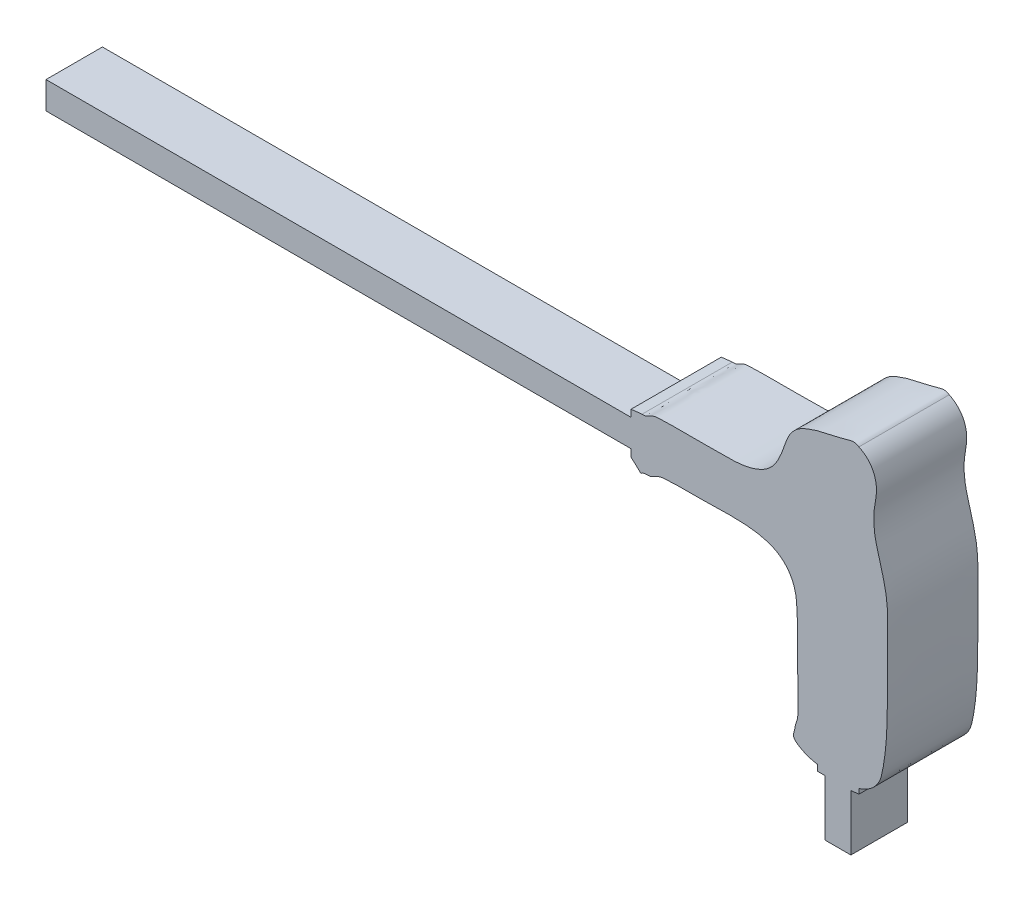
ISO-10303-21;
HEADER;
FILE_DESCRIPTION(('STEP AP214'),'2;1');
FILE_NAME('part.step','',(''),(''),'','','');
FILE_SCHEMA(('AUTOMOTIVE_DESIGN { 1 0 10303 214 1 1 1 1 }'));
ENDSEC;
DATA;
#1=APPLICATION_CONTEXT('core data for automotive mechanical design processes');
#2=APPLICATION_PROTOCOL_DEFINITION('international standard','automotive_design',2000,#1);
#3=PRODUCT_CONTEXT('',#1,'mechanical');
#4=PRODUCT('Part','Part','',(#3));
#5=PRODUCT_RELATED_PRODUCT_CATEGORY('part','',(#4));
#6=PRODUCT_DEFINITION_FORMATION('','',#4);
#7=PRODUCT_DEFINITION_CONTEXT('part definition',#1,'design');
#8=PRODUCT_DEFINITION('design','',#6,#7);
#9=PRODUCT_DEFINITION_SHAPE('','',#8);
#10=(LENGTH_UNIT() NAMED_UNIT(*) SI_UNIT(.MILLI.,.METRE.));
#11=(NAMED_UNIT(*) PLANE_ANGLE_UNIT() SI_UNIT($,.RADIAN.));
#12=(NAMED_UNIT(*) SI_UNIT($,.STERADIAN.) SOLID_ANGLE_UNIT());
#13=UNCERTAINTY_MEASURE_WITH_UNIT(LENGTH_MEASURE(1.E-05),#10,'distance_accuracy_value','');
#14=(GEOMETRIC_REPRESENTATION_CONTEXT(3) GLOBAL_UNCERTAINTY_ASSIGNED_CONTEXT((#13)) GLOBAL_UNIT_ASSIGNED_CONTEXT((#10,
#11,#12)) REPRESENTATION_CONTEXT('',''));
#15=CARTESIAN_POINT('',(0.,0.,0.));
#16=DIRECTION('',(0.,0.,1.));
#17=DIRECTION('',(1.,0.,0.));
#18=AXIS2_PLACEMENT_3D('',#15,#16,#17);
#19=CARTESIAN_POINT('',(244.200239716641,76.7357312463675,-10.));
#20=DIRECTION('',(1.,0.,0.));
#21=DIRECTION('',(0.,0.,-1.));
#22=AXIS2_PLACEMENT_3D('',#19,#20,#21);
#23=PLANE('',#22);
#24=DIRECTION('',(0.,0.,1.));
#25=VECTOR('',#24,1.);
#26=CARTESIAN_POINT('',(244.200239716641,64.3599855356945,-10.));
#27=LINE('',#26,#25);
#28=CARTESIAN_POINT('',(244.200239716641,64.3599855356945,-2.5));
#29=VERTEX_POINT('',#28);
#30=CARTESIAN_POINT('',(244.200239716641,64.3599855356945,10.));
#31=VERTEX_POINT('',#30);
#32=EDGE_CURVE('E195',#29,#31,#27,.T.);
#33=ORIENTED_EDGE('',*,*,#32,.F.);
#34=DIRECTION('',(0.,-1.,0.));
#35=VECTOR('',#34,1.);
#36=CARTESIAN_POINT('',(244.200239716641,64.3599855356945,-2.5));
#37=LINE('',#36,#35);
#38=CARTESIAN_POINT('',(244.200239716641,76.7357312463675,-2.5));
#39=VERTEX_POINT('',#38);
#40=EDGE_CURVE('E173',#39,#29,#37,.T.);
#41=ORIENTED_EDGE('',*,*,#40,.F.);
#42=DIRECTION('',(0.,0.,1.));
#43=VECTOR('',#42,1.);
#44=CARTESIAN_POINT('',(244.200239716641,76.7357312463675,-10.));
#45=LINE('',#44,#43);
#46=CARTESIAN_POINT('',(244.200239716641,76.7357312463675,10.));
#47=VERTEX_POINT('',#46);
#48=EDGE_CURVE('E248',#39,#47,#45,.T.);
#49=ORIENTED_EDGE('',*,*,#48,.T.);
#50=DIRECTION('',(0.,1.,0.));
#51=VECTOR('',#50,1.);
#52=CARTESIAN_POINT('',(244.200239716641,76.7357312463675,10.));
#53=LINE('',#52,#51);
#54=EDGE_CURVE('E259',#31,#47,#53,.T.);
#55=ORIENTED_EDGE('',*,*,#54,.F.);
#56=EDGE_LOOP('',(#33,#41,#49,#55));
#57=FACE_BOUND('',#56,.T.);
#58=ADVANCED_FACE('F39',(#57),#23,.T.);
#59=CARTESIAN_POINT('',(244.200239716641,64.3599855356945,-10.));
#60=DIRECTION('',(0.,-1.,0.));
#61=DIRECTION('',(0.,0.,-1.));
#62=AXIS2_PLACEMENT_3D('',#59,#60,#61);
#63=PLANE('',#62);
#64=DIRECTION('',(0.,0.,1.));
#65=VECTOR('',#64,1.);
#66=CARTESIAN_POINT('',(238.4335121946,64.3599855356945,-10.));
#67=LINE('',#66,#65);
#68=CARTESIAN_POINT('',(238.4335121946,64.3599855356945,-2.5));
#69=VERTEX_POINT('',#68);
#70=CARTESIAN_POINT('',(238.4335121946,64.3599855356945,10.));
#71=VERTEX_POINT('',#70);
#72=EDGE_CURVE('E190',#69,#71,#67,.T.);
#73=ORIENTED_EDGE('',*,*,#72,.F.);
#74=DIRECTION('',(-1.,0.,0.));
#75=VECTOR('',#74,1.);
#76=CARTESIAN_POINT('',(238.4335121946,64.3599855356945,-2.5));
#77=LINE('',#76,#75);
#78=EDGE_CURVE('E179',#29,#69,#77,.T.);
#79=ORIENTED_EDGE('',*,*,#78,.F.);
#80=ORIENTED_EDGE('',*,*,#32,.T.);
#81=DIRECTION('',(1.,0.,0.));
#82=VECTOR('',#81,1.);
#83=CARTESIAN_POINT('',(244.200239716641,64.3599855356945,10.));
#84=LINE('',#83,#82);
#85=EDGE_CURVE('E269',#71,#31,#84,.T.);
#86=ORIENTED_EDGE('',*,*,#85,.F.);
#87=EDGE_LOOP('',(#73,#79,#80,#86));
#88=FACE_BOUND('',#87,.T.);
#89=ADVANCED_FACE('F349',(#88),#63,.T.);
#90=CARTESIAN_POINT('',(238.4335121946,64.3599855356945,-10.));
#91=DIRECTION('',(-1.,0.,0.));
#92=DIRECTION('',(0.,0.,1.));
#93=AXIS2_PLACEMENT_3D('',#90,#91,#92);
#94=PLANE('',#93);
#95=DIRECTION('',(0.,0.,1.));
#96=VECTOR('',#95,1.);
#97=CARTESIAN_POINT('',(238.4335121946,76.7357312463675,-10.));
#98=LINE('',#97,#96);
#99=CARTESIAN_POINT('',(238.4335121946,76.7357312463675,-2.5));
#100=VERTEX_POINT('',#99);
#101=CARTESIAN_POINT('',(238.4335121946,76.7357312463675,10.));
#102=VERTEX_POINT('',#101);
#103=EDGE_CURVE('E166',#100,#102,#98,.T.);
#104=ORIENTED_EDGE('',*,*,#103,.F.);
#105=DIRECTION('',(0.,1.,0.));
#106=VECTOR('',#105,1.);
#107=CARTESIAN_POINT('',(238.4335121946,64.3599855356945,-2.5));
#108=LINE('',#107,#106);
#109=EDGE_CURVE('E174',#69,#100,#108,.T.);
#110=ORIENTED_EDGE('',*,*,#109,.F.);
#111=ORIENTED_EDGE('',*,*,#72,.T.);
#112=DIRECTION('',(0.,-1.,0.));
#113=VECTOR('',#112,1.);
#114=CARTESIAN_POINT('',(238.4335121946,64.3599855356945,10.));
#115=LINE('',#114,#113);
#116=EDGE_CURVE('E188',#102,#71,#115,.T.);
#117=ORIENTED_EDGE('',*,*,#116,.F.);
#118=EDGE_LOOP('',(#104,#110,#111,#117));
#119=FACE_BOUND('',#118,.T.);
#120=ADVANCED_FACE('F186',(#119),#94,.T.);
#121=CARTESIAN_POINT('',(195.497714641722,125.540072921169,-10.));
#122=DIRECTION('',(-0.111022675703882,0.993817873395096,0.));
#123=DIRECTION('',(-0.993817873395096,-0.111022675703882,0.));
#124=AXIS2_PLACEMENT_3D('',#121,#122,#123);
#125=PLANE('',#124);
#126=DIRECTION('',(0.,0.,1.));
#127=VECTOR('',#126,1.);
#128=CARTESIAN_POINT('',(195.497714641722,125.540072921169,-10.));
#129=LINE('',#128,#127);
#130=CARTESIAN_POINT('',(195.497714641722,125.540072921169,-10.));
#131=VERTEX_POINT('',#130);
#132=CARTESIAN_POINT('',(195.497714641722,125.540072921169,10.));
#133=VERTEX_POINT('',#132);
#134=EDGE_CURVE('E11',#131,#133,#129,.T.);
#135=ORIENTED_EDGE('',*,*,#134,.T.);
#136=DIRECTION('',(-0.993817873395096,-0.111022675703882,0.));
#137=VECTOR('',#136,1.);
#138=CARTESIAN_POINT('',(195.497714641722,125.540072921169,10.));
#139=LINE('',#138,#137);
#140=CARTESIAN_POINT('',(197.943057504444,125.813250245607,10.));
#141=VERTEX_POINT('',#140);
#142=EDGE_CURVE('E296',#141,#133,#139,.T.);
#143=ORIENTED_EDGE('',*,*,#142,.F.);
#144=DIRECTION('',(0.,0.,1.));
#145=VECTOR('',#144,1.);
#146=CARTESIAN_POINT('',(197.943057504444,125.813250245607,-10.));
#147=LINE('',#146,#145);
#148=CARTESIAN_POINT('',(197.943057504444,125.813250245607,-10.));
#149=VERTEX_POINT('',#148);
#150=EDGE_CURVE('E49',#149,#141,#147,.T.);
#151=ORIENTED_EDGE('',*,*,#150,.F.);
#152=DIRECTION('',(-0.993817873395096,-0.111022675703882,0.));
#153=VECTOR('',#152,1.);
#154=CARTESIAN_POINT('',(195.497714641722,125.540072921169,-10.));
#155=LINE('',#154,#153);
#156=EDGE_CURVE('E222',#149,#131,#155,.T.);
#157=ORIENTED_EDGE('',*,*,#156,.T.);
#158=EDGE_LOOP('',(#135,#143,#151,#157));
#159=FACE_BOUND('',#158,.T.);
#160=ADVANCED_FACE('F359',(#159),#125,.T.);
#161=CARTESIAN_POINT('',(245.99184260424,143.557265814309,-10.));
#162=CARTESIAN_POINT('',(245.078392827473,144.226488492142,-10.));
#163=CARTESIAN_POINT('',(242.148541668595,143.16497191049,-10.));
#164=CARTESIAN_POINT('',(238.253004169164,142.539143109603,-10.));
#165=CARTESIAN_POINT('',(234.684818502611,141.446956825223,-10.));
#166=CARTESIAN_POINT('',(232.208881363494,140.197703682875,-10.));
#167=CARTESIAN_POINT('',(230.148539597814,137.918538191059,-10.));
#168=CARTESIAN_POINT('',(229.092041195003,133.98962434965,-10.));
#169=CARTESIAN_POINT('',(226.975041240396,129.687062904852,-10.));
#170=CARTESIAN_POINT('',(222.661130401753,127.486615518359,-10.));
#171=CARTESIAN_POINT('',(218.627037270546,126.936784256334,-10.));
#172=CARTESIAN_POINT('',(214.848083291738,127.007534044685,-10.));
#173=CARTESIAN_POINT('',(211.54134581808,126.935471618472,-10.));
#174=CARTESIAN_POINT('',(208.474048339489,126.954576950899,-10.));
#175=CARTESIAN_POINT('',(205.558901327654,126.94550967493,-10.));
#176=CARTESIAN_POINT('',(203.289474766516,126.962166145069,-10.));
#177=CARTESIAN_POINT('',(201.643976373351,126.851415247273,-10.));
#178=CARTESIAN_POINT('',(199.959921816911,126.762022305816,-10.));
#179=CARTESIAN_POINT('',(198.992423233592,125.653607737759,-10.));
#180=CARTESIAN_POINT('',(197.943057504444,125.813250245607,-10.));
#181=B_SPLINE_CURVE_WITH_KNOTS('',3,(#161,#162,#163,#164,#165,#166,#167,#168,#169,#170,#171,
#172,#173,#174,#175,#176,#177,#178,#179,#180),.UNSPECIFIED.,.F.,.F.,(4,1,1,1,1,1,1,1,1,1,1,1,1,
1,1,1,1,4),(0.,0.0567406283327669,0.152495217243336,0.220657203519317,0.25588331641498,
0.301296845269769,0.381016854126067,0.474190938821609,0.548887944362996,0.631271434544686,
0.692674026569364,0.752836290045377,0.809894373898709,0.858269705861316,0.910369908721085,
0.932112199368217,0.947728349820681,1.),.UNSPECIFIED.);
#182=DIRECTION('',(0.,0.,1.));
#183=VECTOR('',#182,1.);
#184=SURFACE_OF_LINEAR_EXTRUSION('',#181,#183);
#185=ORIENTED_EDGE('',*,*,#150,.T.);
#186=CARTESIAN_POINT('',(245.99184260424,143.557265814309,10.));
#187=CARTESIAN_POINT('',(245.078392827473,144.226488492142,10.));
#188=CARTESIAN_POINT('',(242.148541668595,143.16497191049,10.));
#189=CARTESIAN_POINT('',(238.253004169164,142.539143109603,10.));
#190=CARTESIAN_POINT('',(234.684818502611,141.446956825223,10.));
#191=CARTESIAN_POINT('',(232.208881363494,140.197703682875,10.));
#192=CARTESIAN_POINT('',(230.148539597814,137.918538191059,10.));
#193=CARTESIAN_POINT('',(229.092041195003,133.98962434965,10.));
#194=CARTESIAN_POINT('',(226.975041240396,129.687062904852,10.));
#195=CARTESIAN_POINT('',(222.661130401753,127.486615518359,10.));
#196=CARTESIAN_POINT('',(218.627037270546,126.936784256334,10.));
#197=CARTESIAN_POINT('',(214.848083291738,127.007534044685,10.));
#198=CARTESIAN_POINT('',(211.54134581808,126.935471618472,10.));
#199=CARTESIAN_POINT('',(208.474048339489,126.954576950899,10.));
#200=CARTESIAN_POINT('',(205.558901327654,126.94550967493,10.));
#201=CARTESIAN_POINT('',(203.289474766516,126.962166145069,10.));
#202=CARTESIAN_POINT('',(201.643976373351,126.851415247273,10.));
#203=CARTESIAN_POINT('',(199.959921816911,126.762022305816,10.));
#204=CARTESIAN_POINT('',(198.992423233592,125.653607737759,10.));
#205=CARTESIAN_POINT('',(197.943057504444,125.813250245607,10.));
#206=B_SPLINE_CURVE_WITH_KNOTS('',3,(#186,#187,#188,#189,#190,#191,#192,#193,#194,#195,#196,
#197,#198,#199,#200,#201,#202,#203,#204,#205),.UNSPECIFIED.,.F.,.F.,(4,1,1,1,1,1,1,1,1,1,1,1,1,
1,1,1,1,4),(0.,0.0567406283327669,0.152495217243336,0.220657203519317,0.25588331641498,
0.301296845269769,0.381016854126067,0.474190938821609,0.548887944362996,0.631271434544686,
0.692674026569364,0.752836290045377,0.809894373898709,0.858269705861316,0.910369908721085,
0.932112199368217,0.947728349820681,1.),.UNSPECIFIED.);
#207=CARTESIAN_POINT('',(245.99184260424,143.557265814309,10.));
#208=VERTEX_POINT('',#207);
#209=EDGE_CURVE('E287',#208,#141,#206,.T.);
#210=ORIENTED_EDGE('',*,*,#209,.F.);
#211=DIRECTION('',(0.,0.,1.));
#212=VECTOR('',#211,1.);
#213=CARTESIAN_POINT('',(245.99184260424,143.557265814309,-10.));
#214=LINE('',#213,#212);
#215=CARTESIAN_POINT('',(245.99184260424,143.557265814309,-10.));
#216=VERTEX_POINT('',#215);
#217=EDGE_CURVE('E238',#216,#208,#214,.T.);
#218=ORIENTED_EDGE('',*,*,#217,.F.);
#219=EDGE_CURVE('E225',#216,#149,#181,.T.);
#220=ORIENTED_EDGE('',*,*,#219,.T.);
#221=EDGE_LOOP('',(#185,#210,#218,#220));
#222=FACE_BOUND('',#221,.T.);
#223=ADVANCED_FACE('F375',(#222),#184,.T.);
#224=CARTESIAN_POINT('',(245.99184260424,78.0425217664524,-10.));
#225=CARTESIAN_POINT('',(247.801295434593,78.5203071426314,-10.));
#226=CARTESIAN_POINT('',(250.49725531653,80.4975512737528,-10.));
#227=CARTESIAN_POINT('',(251.418067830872,84.8854401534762,-10.));
#228=CARTESIAN_POINT('',(252.06566440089,89.5057606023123,-10.));
#229=CARTESIAN_POINT('',(252.288645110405,95.240217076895,-10.));
#230=CARTESIAN_POINT('',(252.379557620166,101.542835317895,-10.));
#231=CARTESIAN_POINT('',(252.358522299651,107.105758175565,-10.));
#232=CARTESIAN_POINT('',(252.35982701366,112.122415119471,-10.));
#233=CARTESIAN_POINT('',(252.36935219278,116.605449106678,-10.));
#234=CARTESIAN_POINT('',(251.42488519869,121.264419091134,-10.));
#235=CARTESIAN_POINT('',(250.23433298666,125.223812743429,-10.));
#236=CARTESIAN_POINT('',(249.354587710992,128.763510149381,-10.));
#237=CARTESIAN_POINT('',(249.268414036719,131.222384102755,-10.));
#238=CARTESIAN_POINT('',(249.319190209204,133.663097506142,-10.));
#239=CARTESIAN_POINT('',(249.870199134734,135.851869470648,-10.));
#240=CARTESIAN_POINT('',(249.913740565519,138.419589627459,-10.));
#241=CARTESIAN_POINT('',(248.993977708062,141.361715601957,-10.));
#242=CARTESIAN_POINT('',(247.266442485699,142.968169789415,-10.));
#243=CARTESIAN_POINT('',(245.99184260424,143.557265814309,-10.));
#244=B_SPLINE_CURVE_WITH_KNOTS('',3,(#224,#225,#226,#227,#228,#229,#230,#231,#232,#233,#234,
#235,#236,#237,#238,#239,#240,#241,#242,#243),.UNSPECIFIED.,.F.,.F.,(4,1,1,1,1,1,1,1,1,1,1,1,1,
1,1,1,1,4),(0.,0.0819029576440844,0.126703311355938,0.188499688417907,0.283419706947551,
0.372425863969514,0.459545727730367,0.522309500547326,0.588149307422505,0.65153729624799,
0.725488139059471,0.766125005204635,0.807622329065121,0.830764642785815,0.870758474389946,
0.903996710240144,0.939948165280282,1.),.UNSPECIFIED.);
#245=DIRECTION('',(0.,0.,1.));
#246=VECTOR('',#245,1.);
#247=SURFACE_OF_LINEAR_EXTRUSION('',#244,#246);
#248=ORIENTED_EDGE('',*,*,#217,.T.);
#249=CARTESIAN_POINT('',(245.99184260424,78.0425217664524,10.));
#250=CARTESIAN_POINT('',(247.801295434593,78.5203071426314,10.));
#251=CARTESIAN_POINT('',(250.49725531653,80.4975512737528,10.));
#252=CARTESIAN_POINT('',(251.418067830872,84.8854401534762,10.));
#253=CARTESIAN_POINT('',(252.06566440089,89.5057606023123,10.));
#254=CARTESIAN_POINT('',(252.288645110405,95.240217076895,10.));
#255=CARTESIAN_POINT('',(252.379557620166,101.542835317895,10.));
#256=CARTESIAN_POINT('',(252.358522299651,107.105758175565,10.));
#257=CARTESIAN_POINT('',(252.35982701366,112.122415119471,10.));
#258=CARTESIAN_POINT('',(252.36935219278,116.605449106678,10.));
#259=CARTESIAN_POINT('',(251.42488519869,121.264419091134,10.));
#260=CARTESIAN_POINT('',(250.23433298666,125.223812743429,10.));
#261=CARTESIAN_POINT('',(249.354587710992,128.763510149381,10.));
#262=CARTESIAN_POINT('',(249.268414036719,131.222384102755,10.));
#263=CARTESIAN_POINT('',(249.319190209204,133.663097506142,10.));
#264=CARTESIAN_POINT('',(249.870199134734,135.851869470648,10.));
#265=CARTESIAN_POINT('',(249.913740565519,138.419589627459,10.));
#266=CARTESIAN_POINT('',(248.993977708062,141.361715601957,10.));
#267=CARTESIAN_POINT('',(247.266442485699,142.968169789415,10.));
#268=CARTESIAN_POINT('',(245.99184260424,143.557265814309,10.));
#269=B_SPLINE_CURVE_WITH_KNOTS('',3,(#249,#250,#251,#252,#253,#254,#255,#256,#257,#258,#259,
#260,#261,#262,#263,#264,#265,#266,#267,#268),.UNSPECIFIED.,.F.,.F.,(4,1,1,1,1,1,1,1,1,1,1,1,1,
1,1,1,1,4),(0.,0.0819029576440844,0.126703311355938,0.188499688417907,0.283419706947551,
0.372425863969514,0.459545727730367,0.522309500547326,0.588149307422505,0.65153729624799,
0.725488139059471,0.766125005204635,0.807622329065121,0.830764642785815,0.870758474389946,
0.903996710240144,0.939948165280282,1.),.UNSPECIFIED.);
#270=CARTESIAN_POINT('',(245.99184260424,78.0425217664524,10.));
#271=VERTEX_POINT('',#270);
#272=EDGE_CURVE('E278',#271,#208,#269,.T.);
#273=ORIENTED_EDGE('',*,*,#272,.F.);
#274=DIRECTION('',(0.,0.,1.));
#275=VECTOR('',#274,1.);
#276=CARTESIAN_POINT('',(245.99184260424,78.0425217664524,-10.));
#277=LINE('',#276,#275);
#278=CARTESIAN_POINT('',(245.99184260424,78.0425217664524,-10.));
#279=VERTEX_POINT('',#278);
#280=EDGE_CURVE('E241',#279,#271,#277,.T.);
#281=ORIENTED_EDGE('',*,*,#280,.F.);
#282=EDGE_CURVE('E229',#279,#216,#244,.T.);
#283=ORIENTED_EDGE('',*,*,#282,.T.);
#284=EDGE_LOOP('',(#248,#273,#281,#283));
#285=FACE_BOUND('',#284,.T.);
#286=ADVANCED_FACE('F370',(#285),#247,.T.);
#287=CARTESIAN_POINT('',(245.99184260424,78.0425217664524,-10.));
#288=DIRECTION('',(1.,0.,0.));
#289=DIRECTION('',(0.,0.,-1.));
#290=AXIS2_PLACEMENT_3D('',#287,#288,#289);
#291=PLANE('',#290);
#292=ORIENTED_EDGE('',*,*,#280,.T.);
#293=DIRECTION('',(0.,1.,0.));
#294=VECTOR('',#293,1.);
#295=CARTESIAN_POINT('',(245.99184260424,78.0425217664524,10.));
#296=LINE('',#295,#294);
#297=CARTESIAN_POINT('',(245.99184260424,76.935877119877,10.));
#298=VERTEX_POINT('',#297);
#299=EDGE_CURVE('E275',#298,#271,#296,.T.);
#300=ORIENTED_EDGE('',*,*,#299,.F.);
#301=DIRECTION('',(0.,0.,1.));
#302=VECTOR('',#301,1.);
#303=CARTESIAN_POINT('',(245.99184260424,76.935877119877,-10.));
#304=LINE('',#303,#302);
#305=CARTESIAN_POINT('',(245.99184260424,76.935877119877,-10.));
#306=VERTEX_POINT('',#305);
#307=EDGE_CURVE('E244',#306,#298,#304,.T.);
#308=ORIENTED_EDGE('',*,*,#307,.F.);
#309=DIRECTION('',(0.,1.,0.));
#310=VECTOR('',#309,1.);
#311=CARTESIAN_POINT('',(245.99184260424,78.0425217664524,-10.));
#312=LINE('',#311,#310);
#313=EDGE_CURVE('E386',#306,#279,#312,.T.);
#314=ORIENTED_EDGE('',*,*,#313,.T.);
#315=EDGE_LOOP('',(#292,#300,#308,#314));
#316=FACE_BOUND('',#315,.T.);
#317=ADVANCED_FACE('F366',(#316),#291,.T.);
#318=CARTESIAN_POINT('',(245.99184260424,76.935877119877,-10.));
#319=DIRECTION('',(0.111022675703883,-0.993817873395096,0.));
#320=DIRECTION('',(0.993817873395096,0.111022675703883,0.));
#321=AXIS2_PLACEMENT_3D('',#318,#319,#320);
#322=PLANE('',#321);
#323=ORIENTED_EDGE('',*,*,#307,.T.);
#324=DIRECTION('',(0.993817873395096,0.111022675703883,0.));
#325=VECTOR('',#324,1.);
#326=CARTESIAN_POINT('',(245.99184260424,76.935877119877,10.));
#327=LINE('',#326,#325);
#328=EDGE_CURVE('E267',#47,#298,#327,.T.);
#329=ORIENTED_EDGE('',*,*,#328,.F.);
#330=ORIENTED_EDGE('',*,*,#48,.F.);
#331=CARTESIAN_POINT('',(244.200239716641,76.7357312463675,-10.));
#332=VERTEX_POINT('',#331);
#333=EDGE_CURVE('E169',#332,#39,#45,.T.);
#334=ORIENTED_EDGE('',*,*,#333,.F.);
#335=DIRECTION('',(0.993817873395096,0.111022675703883,0.));
#336=VECTOR('',#335,1.);
#337=CARTESIAN_POINT('',(245.99184260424,76.935877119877,-10.));
#338=LINE('',#337,#336);
#339=EDGE_CURVE('E393',#332,#306,#338,.T.);
#340=ORIENTED_EDGE('',*,*,#339,.T.);
#341=EDGE_LOOP('',(#323,#329,#330,#334,#340));
#342=FACE_BOUND('',#341,.T.);
#343=ADVANCED_FACE('F272',(#342),#322,.T.);
#344=CARTESIAN_POINT('',(238.4335121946,76.7357312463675,-10.));
#345=DIRECTION('',(0.,-1.,0.));
#346=DIRECTION('',(0.,0.,-1.));
#347=AXIS2_PLACEMENT_3D('',#344,#345,#346);
#348=PLANE('',#347);
#349=DIRECTION('',(1.,0.,0.));
#350=VECTOR('',#349,1.);
#351=CARTESIAN_POINT('',(238.4335121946,76.7357312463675,-10.));
#352=LINE('',#351,#350);
#353=CARTESIAN_POINT('',(236.843581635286,76.7357312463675,-10.));
#354=VERTEX_POINT('',#353);
#355=EDGE_CURVE('E395',#354,#332,#352,.T.);
#356=ORIENTED_EDGE('',*,*,#355,.T.);
#357=ORIENTED_EDGE('',*,*,#333,.T.);
#358=DIRECTION('',(1.,0.,0.));
#359=VECTOR('',#358,1.);
#360=CARTESIAN_POINT('',(238.4335121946,76.7357312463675,-2.5));
#361=LINE('',#360,#359);
#362=EDGE_CURVE('E161',#100,#39,#361,.T.);
#363=ORIENTED_EDGE('',*,*,#362,.F.);
#364=ORIENTED_EDGE('',*,*,#103,.T.);
#365=DIRECTION('',(1.,0.,0.));
#366=VECTOR('',#365,1.);
#367=CARTESIAN_POINT('',(238.4335121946,76.7357312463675,10.));
#368=LINE('',#367,#366);
#369=CARTESIAN_POINT('',(236.843581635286,76.7357312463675,10.));
#370=VERTEX_POINT('',#369);
#371=EDGE_CURVE('E435',#370,#102,#368,.T.);
#372=ORIENTED_EDGE('',*,*,#371,.F.);
#373=DIRECTION('',(0.,0.,1.));
#374=VECTOR('',#373,1.);
#375=CARTESIAN_POINT('',(236.843581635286,76.7357312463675,-10.));
#376=LINE('',#375,#374);
#377=EDGE_CURVE('E191',#354,#370,#376,.T.);
#378=ORIENTED_EDGE('',*,*,#377,.F.);
#379=EDGE_LOOP('',(#356,#357,#363,#364,#372,#378));
#380=FACE_BOUND('',#379,.T.);
#381=ADVANCED_FACE('F163',(#380),#348,.T.);
#382=CARTESIAN_POINT('',(236.843581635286,76.7357312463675,-10.));
#383=DIRECTION('',(-1.,0.,0.));
#384=DIRECTION('',(0.,0.,1.));
#385=AXIS2_PLACEMENT_3D('',#382,#383,#384);
#386=PLANE('',#385);
#387=ORIENTED_EDGE('',*,*,#377,.T.);
#388=DIRECTION('',(0.,-1.,0.));
#389=VECTOR('',#388,1.);
#390=CARTESIAN_POINT('',(236.843581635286,76.7357312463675,10.));
#391=LINE('',#390,#389);
#392=CARTESIAN_POINT('',(236.843581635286,78.0425217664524,10.));
#393=VERTEX_POINT('',#392);
#394=EDGE_CURVE('E422',#393,#370,#391,.T.);
#395=ORIENTED_EDGE('',*,*,#394,.F.);
#396=DIRECTION('',(0.,0.,1.));
#397=VECTOR('',#396,1.);
#398=CARTESIAN_POINT('',(236.843581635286,78.0425217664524,-10.));
#399=LINE('',#398,#397);
#400=CARTESIAN_POINT('',(236.843581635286,78.0425217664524,-10.));
#401=VERTEX_POINT('',#400);
#402=EDGE_CURVE('E197',#401,#393,#399,.T.);
#403=ORIENTED_EDGE('',*,*,#402,.F.);
#404=DIRECTION('',(0.,-1.,0.));
#405=VECTOR('',#404,1.);
#406=CARTESIAN_POINT('',(236.843581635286,76.7357312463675,-10.));
#407=LINE('',#406,#405);
#408=EDGE_CURVE('E317',#401,#354,#407,.T.);
#409=ORIENTED_EDGE('',*,*,#408,.T.);
#410=EDGE_LOOP('',(#387,#395,#403,#409));
#411=FACE_BOUND('',#410,.T.);
#412=ADVANCED_FACE('F328',(#411),#386,.T.);
#413=CARTESIAN_POINT('',(197.705183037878,114.309075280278,-10.));
#414=CARTESIAN_POINT('',(198.232852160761,114.845899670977,-10.));
#415=CARTESIAN_POINT('',(199.876415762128,114.437945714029,-10.));
#416=CARTESIAN_POINT('',(201.411409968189,115.788128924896,-10.));
#417=CARTESIAN_POINT('',(205.015840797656,116.116279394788,-10.));
#418=CARTESIAN_POINT('',(210.27428122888,115.968831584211,-10.));
#419=CARTESIAN_POINT('',(217.495331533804,116.283400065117,-10.));
#420=CARTESIAN_POINT('',(223.748837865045,116.02177246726,-10.));
#421=CARTESIAN_POINT('',(228.28072075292,114.375318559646,-10.));
#422=CARTESIAN_POINT('',(230.552288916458,112.024802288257,-10.));
#423=CARTESIAN_POINT('',(231.902730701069,109.310050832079,-10.));
#424=CARTESIAN_POINT('',(232.375496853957,105.606473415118,-10.));
#425=CARTESIAN_POINT('',(232.295179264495,101.04459366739,-10.));
#426=CARTESIAN_POINT('',(232.47067030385,95.8930228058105,-10.));
#427=CARTESIAN_POINT('',(232.45446207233,91.5434529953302,-10.));
#428=CARTESIAN_POINT('',(232.398121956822,87.9551687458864,-10.));
#429=CARTESIAN_POINT('',(232.561197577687,85.7866572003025,-10.));
#430=CARTESIAN_POINT('',(232.290333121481,84.1822785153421,-10.));
#431=CARTESIAN_POINT('',(231.859692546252,83.1844647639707,-10.));
#432=CARTESIAN_POINT('',(231.780761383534,82.0532266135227,-10.));
#433=CARTESIAN_POINT('',(231.198458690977,80.6143984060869,-10.));
#434=CARTESIAN_POINT('',(233.521456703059,78.8446305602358,-10.));
#435=CARTESIAN_POINT('',(235.284562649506,78.3162999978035,-10.));
#436=CARTESIAN_POINT('',(236.843581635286,78.0425217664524,-10.));
#437=B_SPLINE_CURVE_WITH_KNOTS('',3,(#413,#414,#415,#416,#417,#418,#419,#420,#421,#422,#423,
#424,#425,#426,#427,#428,#429,#430,#431,#432,#433,#434,#435,#436),.UNSPECIFIED.,.F.,.F.,(4,1,1,
1,1,1,1,1,1,1,1,1,1,1,1,1,1,1,1,1,1,4),(0.,0.028350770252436,0.0618772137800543,
0.0777315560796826,0.177302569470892,0.282081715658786,0.378694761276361,0.436891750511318,
0.477373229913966,0.51173289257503,0.561611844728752,0.630861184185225,0.702248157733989,
0.776277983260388,0.812091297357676,0.85192640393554,0.866314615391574,0.879521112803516,
0.89653224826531,0.914436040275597,0.936716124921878,1.),.UNSPECIFIED.);
#438=DIRECTION('',(0.,0.,1.));
#439=VECTOR('',#438,1.);
#440=SURFACE_OF_LINEAR_EXTRUSION('',#437,#439);
#441=ORIENTED_EDGE('',*,*,#402,.T.);
#442=CARTESIAN_POINT('',(197.705183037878,114.309075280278,10.));
#443=CARTESIAN_POINT('',(198.232852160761,114.845899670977,10.));
#444=CARTESIAN_POINT('',(199.876415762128,114.437945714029,10.));
#445=CARTESIAN_POINT('',(201.411409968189,115.788128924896,10.));
#446=CARTESIAN_POINT('',(205.015840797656,116.116279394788,10.));
#447=CARTESIAN_POINT('',(210.27428122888,115.968831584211,10.));
#448=CARTESIAN_POINT('',(217.495331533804,116.283400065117,10.));
#449=CARTESIAN_POINT('',(223.748837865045,116.02177246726,10.));
#450=CARTESIAN_POINT('',(228.28072075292,114.375318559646,10.));
#451=CARTESIAN_POINT('',(230.552288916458,112.024802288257,10.));
#452=CARTESIAN_POINT('',(231.902730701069,109.310050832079,10.));
#453=CARTESIAN_POINT('',(232.375496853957,105.606473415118,10.));
#454=CARTESIAN_POINT('',(232.295179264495,101.04459366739,10.));
#455=CARTESIAN_POINT('',(232.47067030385,95.8930228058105,10.));
#456=CARTESIAN_POINT('',(232.45446207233,91.5434529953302,10.));
#457=CARTESIAN_POINT('',(232.398121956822,87.9551687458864,10.));
#458=CARTESIAN_POINT('',(232.561197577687,85.7866572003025,10.));
#459=CARTESIAN_POINT('',(232.290333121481,84.1822785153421,10.));
#460=CARTESIAN_POINT('',(231.859692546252,83.1844647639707,10.));
#461=CARTESIAN_POINT('',(231.780761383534,82.0532266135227,10.));
#462=CARTESIAN_POINT('',(231.198458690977,80.6143984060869,10.));
#463=CARTESIAN_POINT('',(233.521456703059,78.8446305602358,10.));
#464=CARTESIAN_POINT('',(235.284562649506,78.3162999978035,10.));
#465=CARTESIAN_POINT('',(236.843581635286,78.0425217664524,10.));
#466=B_SPLINE_CURVE_WITH_KNOTS('',3,(#442,#443,#444,#445,#446,#447,#448,#449,#450,#451,#452,
#453,#454,#455,#456,#457,#458,#459,#460,#461,#462,#463,#464,#465),.UNSPECIFIED.,.F.,.F.,(4,1,1,
1,1,1,1,1,1,1,1,1,1,1,1,1,1,1,1,1,1,4),(0.,0.028350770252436,0.0618772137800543,
0.0777315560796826,0.177302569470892,0.282081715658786,0.378694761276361,0.436891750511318,
0.477373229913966,0.51173289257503,0.561611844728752,0.630861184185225,0.702248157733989,
0.776277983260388,0.812091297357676,0.85192640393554,0.866314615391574,0.879521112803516,
0.89653224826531,0.914436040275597,0.936716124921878,1.),.UNSPECIFIED.);
#467=CARTESIAN_POINT('',(197.705183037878,114.309075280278,10.));
#468=VERTEX_POINT('',#467);
#469=EDGE_CURVE('E409',#468,#393,#466,.T.);
#470=ORIENTED_EDGE('',*,*,#469,.F.);
#471=DIRECTION('',(0.,0.,1.));
#472=VECTOR('',#471,1.);
#473=CARTESIAN_POINT('',(197.705183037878,114.309075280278,-10.));
#474=LINE('',#473,#472);
#475=CARTESIAN_POINT('',(197.705183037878,114.309075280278,-10.));
#476=VERTEX_POINT('',#475);
#477=EDGE_CURVE('E203',#476,#468,#474,.T.);
#478=ORIENTED_EDGE('',*,*,#477,.F.);
#479=EDGE_CURVE('E310',#476,#401,#437,.T.);
#480=ORIENTED_EDGE('',*,*,#479,.T.);
#481=EDGE_LOOP('',(#441,#470,#478,#480));
#482=FACE_BOUND('',#481,.T.);
#483=ADVANCED_FACE('F323',(#482),#440,.T.);
#484=CARTESIAN_POINT('',(195.497714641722,116.351897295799,-10.));
#485=DIRECTION('',(-0.679205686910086,-0.733947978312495,0.));
#486=DIRECTION('',(0.733947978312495,-0.679205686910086,0.));
#487=AXIS2_PLACEMENT_3D('',#484,#485,#486);
#488=PLANE('',#487);
#489=ORIENTED_EDGE('',*,*,#477,.T.);
#490=DIRECTION('',(0.733947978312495,-0.679205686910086,0.));
#491=VECTOR('',#490,1.);
#492=CARTESIAN_POINT('',(195.497714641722,116.351897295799,10.));
#493=LINE('',#492,#491);
#494=CARTESIAN_POINT('',(195.497714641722,116.351897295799,10.));
#495=VERTEX_POINT('',#494);
#496=EDGE_CURVE('E413',#495,#468,#493,.T.);
#497=ORIENTED_EDGE('',*,*,#496,.F.);
#498=DIRECTION('',(0.,0.,1.));
#499=VECTOR('',#498,1.);
#500=CARTESIAN_POINT('',(195.497714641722,116.351897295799,-10.));
#501=LINE('',#500,#499);
#502=CARTESIAN_POINT('',(195.497714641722,116.351897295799,-10.));
#503=VERTEX_POINT('',#502);
#504=EDGE_CURVE('E206',#503,#495,#501,.T.);
#505=ORIENTED_EDGE('',*,*,#504,.F.);
#506=DIRECTION('',(0.733947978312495,-0.679205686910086,0.));
#507=VECTOR('',#506,1.);
#508=CARTESIAN_POINT('',(195.497714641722,116.351897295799,-10.));
#509=LINE('',#508,#507);
#510=EDGE_CURVE('E306',#503,#476,#509,.T.);
#511=ORIENTED_EDGE('',*,*,#510,.T.);
#512=EDGE_LOOP('',(#489,#497,#505,#511));
#513=FACE_BOUND('',#512,.T.);
#514=ADVANCED_FACE('F327',(#513),#488,.T.);
#515=CARTESIAN_POINT('',(195.497714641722,117.964651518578,-10.));
#516=DIRECTION('',(-1.,0.,0.));
#517=DIRECTION('',(0.,0.,1.));
#518=AXIS2_PLACEMENT_3D('',#515,#516,#517);
#519=PLANE('',#518);
#520=ORIENTED_EDGE('',*,*,#504,.T.);
#521=DIRECTION('',(0.,-1.,0.));
#522=VECTOR('',#521,1.);
#523=CARTESIAN_POINT('',(195.497714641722,117.964651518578,10.));
#524=LINE('',#523,#522);
#525=CARTESIAN_POINT('',(195.497714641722,117.964651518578,10.));
#526=VERTEX_POINT('',#525);
#527=EDGE_CURVE('E417',#526,#495,#524,.T.);
#528=ORIENTED_EDGE('',*,*,#527,.F.);
#529=DIRECTION('',(0.,0.,1.));
#530=VECTOR('',#529,1.);
#531=CARTESIAN_POINT('',(195.497714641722,117.964651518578,-10.));
#532=LINE('',#531,#530);
#533=CARTESIAN_POINT('',(195.497714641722,117.964651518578,-2.5));
#534=VERTEX_POINT('',#533);
#535=EDGE_CURVE('E209',#534,#526,#532,.T.);
#536=ORIENTED_EDGE('',*,*,#535,.F.);
#537=DIRECTION('',(0.,-1.,0.));
#538=VECTOR('',#537,1.);
#539=CARTESIAN_POINT('',(195.497714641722,123.990614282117,-2.5));
#540=LINE('',#539,#538);
#541=CARTESIAN_POINT('',(195.497714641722,123.990614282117,-2.5));
#542=VERTEX_POINT('',#541);
#543=EDGE_CURVE('E456',#542,#534,#540,.T.);
#544=ORIENTED_EDGE('',*,*,#543,.F.);
#545=DIRECTION('',(0.,0.,1.));
#546=VECTOR('',#545,1.);
#547=CARTESIAN_POINT('',(195.497714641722,123.990614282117,-10.));
#548=LINE('',#547,#546);
#549=CARTESIAN_POINT('',(195.497714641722,123.990614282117,10.));
#550=VERTEX_POINT('',#549);
#551=EDGE_CURVE('E43',#542,#550,#548,.T.);
#552=ORIENTED_EDGE('',*,*,#551,.T.);
#553=DIRECTION('',(0.,-1.,0.));
#554=VECTOR('',#553,1.);
#555=CARTESIAN_POINT('',(195.497714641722,123.990614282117,10.));
#556=LINE('',#555,#554);
#557=EDGE_CURVE('E441',#133,#550,#556,.T.);
#558=ORIENTED_EDGE('',*,*,#557,.F.);
#559=ORIENTED_EDGE('',*,*,#134,.F.);
#560=DIRECTION('',(0.,-1.,0.));
#561=VECTOR('',#560,1.);
#562=CARTESIAN_POINT('',(195.497714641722,123.990614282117,-10.));
#563=LINE('',#562,#561);
#564=EDGE_CURVE('E303',#131,#503,#563,.T.);
#565=ORIENTED_EDGE('',*,*,#564,.T.);
#566=EDGE_LOOP('',(#520,#528,#536,#544,#552,#558,#559,#565));
#567=FACE_BOUND('',#566,.T.);
#568=ADVANCED_FACE('F333',(#567),#519,.T.);
#569=CARTESIAN_POINT('',(65.8894045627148,117.964651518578,-10.));
#570=DIRECTION('',(0.,-1.,0.));
#571=DIRECTION('',(0.,0.,-1.));
#572=AXIS2_PLACEMENT_3D('',#569,#570,#571);
#573=PLANE('',#572);
#574=DIRECTION('',(-1.,0.,0.));
#575=VECTOR('',#574,1.);
#576=CARTESIAN_POINT('',(65.8894045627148,117.964651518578,-2.5));
#577=LINE('',#576,#575);
#578=CARTESIAN_POINT('',(65.8894045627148,117.964651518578,-2.5));
#579=VERTEX_POINT('',#578);
#580=EDGE_CURVE('E183',#534,#579,#577,.T.);
#581=ORIENTED_EDGE('',*,*,#580,.F.);
#582=ORIENTED_EDGE('',*,*,#535,.T.);
#583=DIRECTION('',(1.,0.,0.));
#584=VECTOR('',#583,1.);
#585=CARTESIAN_POINT('',(65.8894045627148,117.964651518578,10.));
#586=LINE('',#585,#584);
#587=CARTESIAN_POINT('',(65.8894045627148,117.964651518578,10.));
#588=VERTEX_POINT('',#587);
#589=EDGE_CURVE('E424',#588,#526,#586,.T.);
#590=ORIENTED_EDGE('',*,*,#589,.F.);
#591=DIRECTION('',(0.,0.,1.));
#592=VECTOR('',#591,1.);
#593=CARTESIAN_POINT('',(65.8894045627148,117.964651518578,-10.));
#594=LINE('',#593,#592);
#595=EDGE_CURVE('E212',#579,#588,#594,.T.);
#596=ORIENTED_EDGE('',*,*,#595,.F.);
#597=EDGE_LOOP('',(#581,#582,#590,#596));
#598=FACE_BOUND('',#597,.T.);
#599=ADVANCED_FACE('F337',(#598),#573,.T.);
#600=CARTESIAN_POINT('',(65.8894045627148,123.990614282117,-10.));
#601=DIRECTION('',(-1.,0.,0.));
#602=DIRECTION('',(0.,0.,1.));
#603=AXIS2_PLACEMENT_3D('',#600,#601,#602);
#604=PLANE('',#603);
#605=DIRECTION('',(0.,1.,0.));
#606=VECTOR('',#605,1.);
#607=CARTESIAN_POINT('',(65.8894045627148,123.990614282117,-2.5));
#608=LINE('',#607,#606);
#609=CARTESIAN_POINT('',(65.8894045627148,123.990614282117,-2.5));
#610=VERTEX_POINT('',#609);
#611=EDGE_CURVE('E449',#579,#610,#608,.T.);
#612=ORIENTED_EDGE('',*,*,#611,.F.);
#613=ORIENTED_EDGE('',*,*,#595,.T.);
#614=DIRECTION('',(0.,-1.,0.));
#615=VECTOR('',#614,1.);
#616=CARTESIAN_POINT('',(65.8894045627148,123.990614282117,10.));
#617=LINE('',#616,#615);
#618=CARTESIAN_POINT('',(65.8894045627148,123.990614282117,10.));
#619=VERTEX_POINT('',#618);
#620=EDGE_CURVE('E463',#619,#588,#617,.T.);
#621=ORIENTED_EDGE('',*,*,#620,.F.);
#622=DIRECTION('',(0.,0.,1.));
#623=VECTOR('',#622,1.);
#624=CARTESIAN_POINT('',(65.8894045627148,123.990614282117,-10.));
#625=LINE('',#624,#623);
#626=EDGE_CURVE('E214',#610,#619,#625,.T.);
#627=ORIENTED_EDGE('',*,*,#626,.F.);
#628=EDGE_LOOP('',(#612,#613,#621,#627));
#629=FACE_BOUND('',#628,.T.);
#630=ADVANCED_FACE('F339',(#629),#604,.T.);
#631=CARTESIAN_POINT('',(195.497714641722,123.990614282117,-10.));
#632=DIRECTION('',(0.,1.,0.));
#633=DIRECTION('',(-1.,0.,0.));
#634=AXIS2_PLACEMENT_3D('',#631,#632,#633);
#635=PLANE('',#634);
#636=DIRECTION('',(1.,0.,0.));
#637=VECTOR('',#636,1.);
#638=CARTESIAN_POINT('',(65.8894045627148,123.990614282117,-2.5));
#639=LINE('',#638,#637);
#640=EDGE_CURVE('E452',#610,#542,#639,.T.);
#641=ORIENTED_EDGE('',*,*,#640,.F.);
#642=ORIENTED_EDGE('',*,*,#626,.T.);
#643=DIRECTION('',(-1.,0.,0.));
#644=VECTOR('',#643,1.);
#645=CARTESIAN_POINT('',(195.497714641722,123.990614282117,10.));
#646=LINE('',#645,#644);
#647=EDGE_CURVE('E445',#550,#619,#646,.T.);
#648=ORIENTED_EDGE('',*,*,#647,.F.);
#649=ORIENTED_EDGE('',*,*,#551,.F.);
#650=EDGE_LOOP('',(#641,#642,#648,#649));
#651=FACE_BOUND('',#650,.T.);
#652=ADVANCED_FACE('F41',(#651),#635,.T.);
#653=CARTESIAN_POINT('',(225.239086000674,128.932982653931,-10.));
#654=DIRECTION('',(0.,0.,-1.));
#655=DIRECTION('',(-1.,0.,0.));
#656=AXIS2_PLACEMENT_3D('',#653,#654,#655);
#657=PLANE('',#656);
#658=ORIENTED_EDGE('',*,*,#339,.F.);
#659=ORIENTED_EDGE('',*,*,#355,.F.);
#660=ORIENTED_EDGE('',*,*,#408,.F.);
#661=ORIENTED_EDGE('',*,*,#479,.F.);
#662=ORIENTED_EDGE('',*,*,#510,.F.);
#663=ORIENTED_EDGE('',*,*,#564,.F.);
#664=ORIENTED_EDGE('',*,*,#156,.F.);
#665=ORIENTED_EDGE('',*,*,#219,.F.);
#666=ORIENTED_EDGE('',*,*,#282,.F.);
#667=ORIENTED_EDGE('',*,*,#313,.F.);
#668=EDGE_LOOP('',(#658,#659,#660,#661,#662,#663,#664,#665,#666,#667));
#669=FACE_BOUND('',#668,.T.);
#670=ADVANCED_FACE('F346',(#669),#657,.T.);
#671=CARTESIAN_POINT('',(225.239086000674,128.932982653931,10.));
#672=DIRECTION('',(0.,0.,-1.));
#673=DIRECTION('',(-1.,0.,0.));
#674=AXIS2_PLACEMENT_3D('',#671,#672,#673);
#675=PLANE('',#674);
#676=ORIENTED_EDGE('',*,*,#557,.T.);
#677=ORIENTED_EDGE('',*,*,#647,.T.);
#678=ORIENTED_EDGE('',*,*,#620,.T.);
#679=ORIENTED_EDGE('',*,*,#589,.T.);
#680=ORIENTED_EDGE('',*,*,#527,.T.);
#681=ORIENTED_EDGE('',*,*,#496,.T.);
#682=ORIENTED_EDGE('',*,*,#469,.T.);
#683=ORIENTED_EDGE('',*,*,#394,.T.);
#684=ORIENTED_EDGE('',*,*,#371,.T.);
#685=ORIENTED_EDGE('',*,*,#116,.T.);
#686=ORIENTED_EDGE('',*,*,#85,.T.);
#687=ORIENTED_EDGE('',*,*,#54,.T.);
#688=ORIENTED_EDGE('',*,*,#328,.T.);
#689=ORIENTED_EDGE('',*,*,#299,.T.);
#690=ORIENTED_EDGE('',*,*,#272,.T.);
#691=ORIENTED_EDGE('',*,*,#209,.T.);
#692=ORIENTED_EDGE('',*,*,#142,.T.);
#693=EDGE_LOOP('',(#676,#677,#678,#679,#680,#681,#682,#683,#684,#685,#686,#687,#688,#689,#690,
#691,#692));
#694=FACE_BOUND('',#693,.T.);
#695=ADVANCED_FACE('F265',(#694),#675,.F.);
#696=CARTESIAN_POINT('',(0.,0.,-2.5));
#697=DIRECTION('',(0.,0.,1.));
#698=DIRECTION('',(1.,0.,0.));
#699=AXIS2_PLACEMENT_3D('',#696,#697,#698);
#700=PLANE('',#699);
#701=ORIENTED_EDGE('',*,*,#611,.T.);
#702=ORIENTED_EDGE('',*,*,#640,.T.);
#703=ORIENTED_EDGE('',*,*,#543,.T.);
#704=ORIENTED_EDGE('',*,*,#580,.T.);
#705=EDGE_LOOP('',(#701,#702,#703,#704));
#706=FACE_BOUND('',#705,.T.);
#707=ADVANCED_FACE('F488',(#706),#700,.F.);
#708=CARTESIAN_POINT('',(0.,0.,-2.5));
#709=DIRECTION('',(0.,0.,-1.));
#710=DIRECTION('',(-1.,0.,0.));
#711=AXIS2_PLACEMENT_3D('',#708,#709,#710);
#712=PLANE('',#711);
#713=ORIENTED_EDGE('',*,*,#109,.T.);
#714=ORIENTED_EDGE('',*,*,#362,.T.);
#715=ORIENTED_EDGE('',*,*,#40,.T.);
#716=ORIENTED_EDGE('',*,*,#78,.T.);
#717=EDGE_LOOP('',(#713,#714,#715,#716));
#718=FACE_BOUND('',#717,.T.);
#719=ADVANCED_FACE('F177',(#718),#712,.T.);
#720=CLOSED_SHELL('',(#58,#89,#120,#160,#223,#286,#317,#343,#381,#412,#483,#514,#568,#599,#630,
#652,#670,#695,#707,#719));
#721=MANIFOLD_SOLID_BREP('B2',#720);
#722=ADVANCED_BREP_SHAPE_REPRESENTATION('',(#18,#721),#14);
#723=SHAPE_DEFINITION_REPRESENTATION(#9,#722);
ENDSEC;
END-ISO-10303-21;
